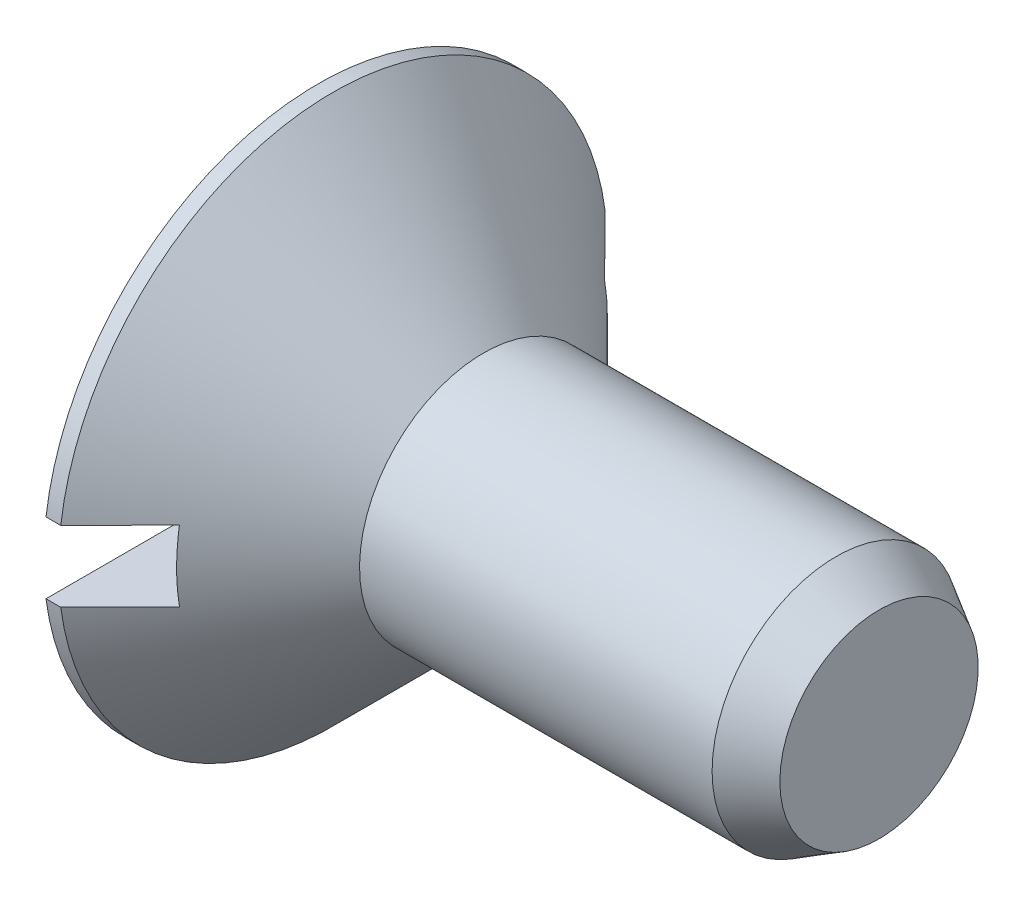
ISO-10303-21;
HEADER;
FILE_DESCRIPTION(('STEP AP214'),'2;1');
FILE_NAME('part.step','',(''),(''),'','','');
FILE_SCHEMA(('AUTOMOTIVE_DESIGN { 1 0 10303 214 1 1 1 1 }'));
ENDSEC;
DATA;
#1=APPLICATION_CONTEXT('core data for automotive mechanical design processes');
#2=APPLICATION_PROTOCOL_DEFINITION('international standard','automotive_design',2000,#1);
#3=PRODUCT_CONTEXT('',#1,'mechanical');
#4=PRODUCT('Part','Part','',(#3));
#5=PRODUCT_RELATED_PRODUCT_CATEGORY('part','',(#4));
#6=PRODUCT_DEFINITION_FORMATION('','',#4);
#7=PRODUCT_DEFINITION_CONTEXT('part definition',#1,'design');
#8=PRODUCT_DEFINITION('design','',#6,#7);
#9=PRODUCT_DEFINITION_SHAPE('','',#8);
#10=(LENGTH_UNIT() NAMED_UNIT(*) SI_UNIT(.MILLI.,.METRE.));
#11=(NAMED_UNIT(*) PLANE_ANGLE_UNIT() SI_UNIT($,.RADIAN.));
#12=(NAMED_UNIT(*) SI_UNIT($,.STERADIAN.) SOLID_ANGLE_UNIT());
#13=UNCERTAINTY_MEASURE_WITH_UNIT(LENGTH_MEASURE(1.E-05),#10,'distance_accuracy_value','');
#14=(GEOMETRIC_REPRESENTATION_CONTEXT(3) GLOBAL_UNCERTAINTY_ASSIGNED_CONTEXT((#13)) GLOBAL_UNIT_ASSIGNED_CONTEXT((#10,
#11,#12)) REPRESENTATION_CONTEXT('',''));
#15=CARTESIAN_POINT('',(0.,0.,0.));
#16=DIRECTION('',(0.,0.,1.));
#17=DIRECTION('',(1.,0.,0.));
#18=AXIS2_PLACEMENT_3D('',#15,#16,#17);
#19=CARTESIAN_POINT('',(0.,0.,0.));
#20=DIRECTION('',(-1.,0.,0.));
#21=DIRECTION('',(0.,0.,1.));
#22=AXIS2_PLACEMENT_3D('',#19,#20,#21);
#23=PLANE('',#22);
#24=DIRECTION('',(0.,0.,1.));
#25=VECTOR('',#24,1.);
#26=CARTESIAN_POINT('',(0.,0.6,-4.65));
#27=LINE('',#26,#25);
#28=CARTESIAN_POINT('',(0.,0.6,-4.61112784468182));
#29=VERTEX_POINT('',#28);
#30=CARTESIAN_POINT('',(0.,0.6,4.61112784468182));
#31=VERTEX_POINT('',#30);
#32=EDGE_CURVE('E188',#29,#31,#27,.T.);
#33=ORIENTED_EDGE('',*,*,#32,.T.);
#34=CARTESIAN_POINT('',(0.,0.,0.));
#35=DIRECTION('',(1.,0.,0.));
#36=DIRECTION('',(0.,0.,-1.));
#37=AXIS2_PLACEMENT_3D('',#34,#35,#36);
#38=CIRCLE('',#37,4.65);
#39=EDGE_CURVE('E125',#29,#31,#38,.T.);
#40=ORIENTED_EDGE('',*,*,#39,.F.);
#41=EDGE_LOOP('',(#33,#40));
#42=FACE_BOUND('',#41,.T.);
#43=ADVANCED_FACE('F45',(#42),#23,.T.);
#44=CARTESIAN_POINT('',(6.62068469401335,0.,0.));
#45=DIRECTION('',(1.,0.,0.));
#46=DIRECTION('',(0.,0.,-1.));
#47=AXIS2_PLACEMENT_3D('',#44,#45,#46);
#48=CYLINDRICAL_SURFACE('',#47,4.65);
#49=DIRECTION('',(1.,0.,0.));
#50=VECTOR('',#49,1.);
#51=CARTESIAN_POINT('',(6.62068469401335,0.6,4.61112784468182));
#52=LINE('',#51,#50);
#53=CARTESIAN_POINT('',(0.249999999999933,0.6,4.61112784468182));
#54=VERTEX_POINT('',#53);
#55=EDGE_CURVE('E185',#54,#31,#52,.F.);
#56=ORIENTED_EDGE('',*,*,#55,.F.);
#57=CARTESIAN_POINT('',(0.249999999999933,0.,0.));
#58=DIRECTION('',(1.,0.,0.));
#59=DIRECTION('',(0.,0.,-1.));
#60=AXIS2_PLACEMENT_3D('',#57,#58,#59);
#61=CIRCLE('',#60,4.65);
#62=CARTESIAN_POINT('',(0.249999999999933,0.6,-4.61112784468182));
#63=VERTEX_POINT('',#62);
#64=EDGE_CURVE('E177',#63,#54,#61,.T.);
#65=ORIENTED_EDGE('',*,*,#64,.F.);
#66=DIRECTION('',(1.,0.,0.));
#67=VECTOR('',#66,1.);
#68=CARTESIAN_POINT('',(6.62068469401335,0.6,-4.61112784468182));
#69=LINE('',#68,#67);
#70=EDGE_CURVE('E68',#29,#63,#69,.T.);
#71=ORIENTED_EDGE('',*,*,#70,.F.);
#72=ORIENTED_EDGE('',*,*,#39,.T.);
#73=EDGE_LOOP('',(#56,#65,#71,#72));
#74=FACE_BOUND('',#73,.T.);
#75=ADVANCED_FACE('F158',(#74),#48,.T.);
#76=DIRECTION('',(0.,0.,1.));
#77=VECTOR('',#76,1.);
#78=CARTESIAN_POINT('',(0.,-0.6,-4.65));
#79=LINE('',#78,#77);
#80=CARTESIAN_POINT('',(0.,-0.6,-4.61112784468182));
#81=VERTEX_POINT('',#80);
#82=CARTESIAN_POINT('',(0.,-0.6,4.61112784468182));
#83=VERTEX_POINT('',#82);
#84=EDGE_CURVE('E116',#81,#83,#79,.T.);
#85=ORIENTED_EDGE('',*,*,#84,.F.);
#86=EDGE_CURVE('E128',#83,#81,#38,.T.);
#87=ORIENTED_EDGE('',*,*,#86,.F.);
#88=EDGE_LOOP('',(#85,#87));
#89=FACE_BOUND('',#88,.T.);
#90=ADVANCED_FACE('F160',(#89),#23,.T.);
#91=DIRECTION('',(1.,0.,0.));
#92=VECTOR('',#91,1.);
#93=CARTESIAN_POINT('',(6.62068469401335,-0.6,-4.61112784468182));
#94=LINE('',#93,#92);
#95=CARTESIAN_POINT('',(0.249999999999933,-0.6,-4.61112784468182));
#96=VERTEX_POINT('',#95);
#97=EDGE_CURVE('E176',#96,#81,#94,.F.);
#98=ORIENTED_EDGE('',*,*,#97,.F.);
#99=CARTESIAN_POINT('',(0.249999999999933,-0.6,4.61112784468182));
#100=VERTEX_POINT('',#99);
#101=EDGE_CURVE('E178',#100,#96,#61,.T.);
#102=ORIENTED_EDGE('',*,*,#101,.F.);
#103=DIRECTION('',(1.,0.,0.));
#104=VECTOR('',#103,1.);
#105=CARTESIAN_POINT('',(6.62068469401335,-0.6,4.61112784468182));
#106=LINE('',#105,#104);
#107=EDGE_CURVE('E99',#83,#100,#106,.T.);
#108=ORIENTED_EDGE('',*,*,#107,.F.);
#109=ORIENTED_EDGE('',*,*,#86,.T.);
#110=EDGE_LOOP('',(#98,#102,#108,#109));
#111=FACE_BOUND('',#110,.T.);
#112=ADVANCED_FACE('F155',(#111),#48,.T.);
#113=CARTESIAN_POINT('',(2.8,0.,0.));
#114=DIRECTION('',(-1.,0.,0.));
#115=DIRECTION('',(0.,0.,1.));
#116=AXIS2_PLACEMENT_3D('',#113,#114,#115);
#117=CONICAL_SURFACE('',#116,2.1,0.785398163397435);
#118=CARTESIAN_POINT('',(-5.36236535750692,0.6,-10.244810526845));
#119=CARTESIAN_POINT('',(-5.01492393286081,0.6,-9.89676929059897));
#120=CARTESIAN_POINT('',(-4.6675085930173,0.6,-9.5487020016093));
#121=CARTESIAN_POINT('',(-3.97275824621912,0.6,-8.8524784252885));
#122=CARTESIAN_POINT('',(-3.6254232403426,0.6,-8.50432213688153));
#123=CARTESIAN_POINT('',(-2.93077201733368,0.6,-7.80779370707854));
#124=CARTESIAN_POINT('',(-2.58345583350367,0.6,-7.45942153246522));
#125=CARTESIAN_POINT('',(-1.88900593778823,0.6,-6.7625039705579));
#126=CARTESIAN_POINT('',(-1.5418722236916,0.6,-6.41395858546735));
#127=CARTESIAN_POINT('',(-0.835034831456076,0.6,-5.70367605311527));
#128=CARTESIAN_POINT('',(-0.475341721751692,0.6,-5.34192838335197));
#129=CARTESIAN_POINT('',(0.0637931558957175,0.6,-4.79889094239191));
#130=CARTESIAN_POINT('',(0.243440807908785,0.6,-4.61780561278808));
#131=CARTESIAN_POINT('',(0.602538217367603,0.6,-4.2554402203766));
#132=CARTESIAN_POINT('',(0.78198797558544,0.6,-4.07416015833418));
#133=CARTESIAN_POINT('',(1.14056709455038,0.6,-3.71134808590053));
#134=CARTESIAN_POINT('',(1.31969650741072,0.6,-3.52981612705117));
#135=CARTESIAN_POINT('',(1.67750681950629,0.6,-3.1663053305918));
#136=CARTESIAN_POINT('',(1.85618771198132,0.6,-2.98432648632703));
#137=CARTESIAN_POINT('',(2.21279362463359,0.6,-2.61965200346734));
#138=CARTESIAN_POINT('',(2.39071869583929,0.6,-2.43695641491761));
#139=CARTESIAN_POINT('',(2.65652848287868,0.6,-2.16187514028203));
#140=CARTESIAN_POINT('',(2.74495104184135,0.6,-2.07000952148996));
#141=CARTESIAN_POINT('',(2.92126344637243,0.6,-1.88576886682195));
#142=CARTESIAN_POINT('',(3.00915329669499,0.6,-1.79339383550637));
#143=CARTESIAN_POINT('',(3.14363246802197,0.6,-1.65078711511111));
#144=CARTESIAN_POINT('',(3.19051519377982,0.6,-1.60083228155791));
#145=CARTESIAN_POINT('',(3.2839678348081,0.6,-1.50062916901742));
#146=CARTESIAN_POINT('',(3.33053774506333,0.6,-1.45038088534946));
#147=CARTESIAN_POINT('',(3.42309309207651,0.6,-1.34968430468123));
#148=CARTESIAN_POINT('',(3.46908003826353,0.6,-1.29923739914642));
#149=CARTESIAN_POINT('',(3.56047910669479,0.6,-1.19782938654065));
#150=CARTESIAN_POINT('',(3.60589124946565,0.6,-1.14686829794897));
#151=CARTESIAN_POINT('',(3.71119354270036,0.6,-1.02682664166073));
#152=CARTESIAN_POINT('',(3.77076775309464,0.6,-0.957465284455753));
#153=CARTESIAN_POINT('',(3.85843446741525,0.6,-0.85161296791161));
#154=CARTESIAN_POINT('',(3.88746885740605,0.6,-0.815904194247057));
#155=CARTESIAN_POINT('',(3.94463825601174,0.6,-0.743776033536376));
#156=CARTESIAN_POINT('',(3.97277335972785,0.6,-0.707356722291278));
#157=CARTESIAN_POINT('',(4.02814415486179,0.6,-0.633052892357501));
#158=CARTESIAN_POINT('',(4.05536222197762,0.6,-0.595155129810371));
#159=CARTESIAN_POINT('',(4.10787021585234,0.6,-0.517952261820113));
#160=CARTESIAN_POINT('',(4.13315748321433,0.6,-0.478645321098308));
#161=CARTESIAN_POINT('',(4.18040572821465,0.6,-0.398562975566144));
#162=CARTESIAN_POINT('',(4.20239717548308,0.6,-0.357805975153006));
#163=CARTESIAN_POINT('',(4.24141981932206,0.6,-0.274042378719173));
#164=CARTESIAN_POINT('',(4.25846680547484,0.6,-0.231043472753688));
#165=CARTESIAN_POINT('',(4.28361225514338,0.6,-0.146293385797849));
#166=CARTESIAN_POINT('',(4.29234785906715,0.6,-0.104746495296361));
#167=CARTESIAN_POINT('',(4.29890711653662,0.6,-0.041851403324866));
#168=CARTESIAN_POINT('',(4.30000676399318,0.6,-0.0208294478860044));
#169=CARTESIAN_POINT('',(4.29999317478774,0.6,0.021212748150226));
#170=CARTESIAN_POINT('',(4.29887986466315,0.6,0.0422329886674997));
#171=CARTESIAN_POINT('',(4.2923271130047,0.6,0.104705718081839));
#172=CARTESIAN_POINT('',(4.28370245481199,0.6,0.145848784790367));
#173=CARTESIAN_POINT('',(4.2658828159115,0.6,0.206119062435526));
#174=CARTESIAN_POINT('',(4.25909422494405,0.6,0.22604077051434));
#175=CARTESIAN_POINT('',(4.24418139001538,0.6,0.265379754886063));
#176=CARTESIAN_POINT('',(4.23605736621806,0.6,0.284797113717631));
#177=CARTESIAN_POINT('',(4.21171067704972,0.6,0.338683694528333));
#178=CARTESIAN_POINT('',(4.19426177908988,0.6,0.372593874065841));
#179=CARTESIAN_POINT('',(4.15699755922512,0.6,0.439101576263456));
#180=CARTESIAN_POINT('',(4.13717958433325,0.6,0.471697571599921));
#181=CARTESIAN_POINT('',(4.09586201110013,0.6,0.535952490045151));
#182=CARTESIAN_POINT('',(4.07435693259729,0.6,0.567607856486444));
#183=CARTESIAN_POINT('',(4.03019875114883,0.6,0.630111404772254));
#184=CARTESIAN_POINT('',(4.00754536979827,0.6,0.660959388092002));
#185=CARTESIAN_POINT('',(3.9379272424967,0.6,0.75315010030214));
#186=CARTESIAN_POINT('',(3.88970782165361,0.6,0.81354123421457));
#187=CARTESIAN_POINT('',(3.79153604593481,0.6,0.932633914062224));
#188=CARTESIAN_POINT('',(3.74158799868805,0.6,0.991339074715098));
#189=CARTESIAN_POINT('',(3.64160285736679,0.6,1.10650906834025));
#190=CARTESIAN_POINT('',(3.59159003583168,0.6,1.16299501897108));
#191=CARTESIAN_POINT('',(3.49082200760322,0.6,1.2753003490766));
#192=CARTESIAN_POINT('',(3.44006678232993,0.6,1.33111971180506));
#193=CARTESIAN_POINT('',(3.28702208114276,0.6,1.49789013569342));
#194=CARTESIAN_POINT('',(3.18396742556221,0.6,1.60813787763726));
#195=CARTESIAN_POINT('',(2.97664172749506,0.6,1.82772673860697));
#196=CARTESIAN_POINT('',(2.87236937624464,0.6,1.93706661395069));
#197=CARTESIAN_POINT('',(2.66315676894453,0.6,2.15508896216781));
#198=CARTESIAN_POINT('',(2.55821656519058,0.6,2.26377148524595));
#199=CARTESIAN_POINT('',(2.3489716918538,0.6,2.47960357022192));
#200=CARTESIAN_POINT('',(2.24467147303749,0.6,2.58675745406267));
#201=CARTESIAN_POINT('',(2.03577071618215,0.6,2.80077615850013));
#202=CARTESIAN_POINT('',(1.93117017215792,0.6,2.90764097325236));
#203=CARTESIAN_POINT('',(1.61715388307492,0.6,3.22782187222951));
#204=CARTESIAN_POINT('',(1.40742246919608,0.6,3.4408282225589));
#205=CARTESIAN_POINT('',(0.927791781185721,0.6,3.92687936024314));
#206=CARTESIAN_POINT('',(0.65774080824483,0.6,4.19977427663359));
#207=CARTESIAN_POINT('',(0.117210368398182,0.6,4.74514082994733));
#208=CARTESIAN_POINT('',(-0.153269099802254,0.6,5.01761246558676));
#209=CARTESIAN_POINT('',(-0.965199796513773,0.6,5.83475977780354));
#210=CARTESIAN_POINT('',(-1.50703268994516,0.6,6.37905610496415));
#211=CARTESIAN_POINT('',(-2.60102565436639,0.6,7.47713689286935));
#212=CARTESIAN_POINT('',(-3.15319380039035,0.6,8.03091330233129));
#213=CARTESIAN_POINT('',(-4.2576821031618,0.6,9.13807762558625));
#214=CARTESIAN_POINT('',(-4.81000220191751,0.6,9.69146559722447));
#215=CARTESIAN_POINT('',(-5.36236535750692,0.6,10.244810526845));
#216=B_SPLINE_CURVE_WITH_KNOTS('',3,(#118,#119,#120,#121,#122,#123,#124,#125,#126,#127,#128,
#129,#130,#131,#132,#133,#134,#135,#136,#137,#138,#139,#140,#141,#142,#143,#144,#145,#146,#147,
#148,#149,#150,#151,#152,#153,#154,#155,#156,#157,#158,#159,#160,#161,#162,#163,#164,#165,#166,
#167,#168,#169,#170,#171,#172,#173,#174,#175,#176,#177,#178,#179,#180,#181,#182,#183,#184,#185,
#186,#187,#188,#189,#190,#191,#192,#193,#194,#195,#196,#197,#198,#199,#200,#201,#202,#203,#204,
#205,#206,#207,#208,#209,#210,#211,#212,#213,#214,#215),.UNSPECIFIED.,.F.,.F.,(4,2,2,2,2,2,2,2,
2,2,2,2,2,2,2,2,2,2,2,2,2,2,2,2,2,2,2,2,2,2,2,2,2,2,2,2,2,2,2,2,2,2,2,2,2,2,2,2,4),(0.,
1.47534207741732,2.95070292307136,4.42648244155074,5.9022436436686,7.43265646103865,
8.19789264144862,8.96312582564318,9.72822050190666,10.4933266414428,11.2583802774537,
11.6408978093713,12.0234119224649,12.2289377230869,12.4344668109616,12.6392486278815,
12.8440231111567,13.1182810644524,13.2563401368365,13.3943845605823,13.5343219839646,
13.6744487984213,13.8131874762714,13.9514781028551,14.0780213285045,14.1410633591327,
14.2041074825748,14.3293725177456,14.3924826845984,14.4555824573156,14.5698365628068,
14.6842198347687,14.7989913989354,14.913790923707,15.1455512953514,15.376770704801,
15.6030949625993,15.8294248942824,16.2821474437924,16.7354120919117,17.1886416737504,
17.6372437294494,18.0858547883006,18.9826423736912,20.1344195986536,21.2862003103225,
23.5902334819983,25.9362986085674,28.2818606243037),.UNSPECIFIED.);
#217=CARTESIAN_POINT('',(1.25,0.6,3.6003472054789));
#218=VERTEX_POINT('',#217);
#219=EDGE_CURVE('E122',#218,#54,#216,.T.);
#220=ORIENTED_EDGE('',*,*,#219,.F.);
#221=CARTESIAN_POINT('',(1.25,0.,0.));
#222=DIRECTION('',(1.,0.,0.));
#223=DIRECTION('',(0.,0.,-1.));
#224=AXIS2_PLACEMENT_3D('',#221,#222,#223);
#225=CIRCLE('',#224,3.64999999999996);
#226=CARTESIAN_POINT('',(1.25,-0.6,3.6003472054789));
#227=VERTEX_POINT('',#226);
#228=EDGE_CURVE('E104',#227,#218,#225,.F.);
#229=ORIENTED_EDGE('',*,*,#228,.F.);
#230=CARTESIAN_POINT('',(-5.36236535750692,-0.6,10.244810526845));
#231=CARTESIAN_POINT('',(-5.01492393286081,-0.6,9.89676929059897));
#232=CARTESIAN_POINT('',(-4.6675085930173,-0.6,9.5487020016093));
#233=CARTESIAN_POINT('',(-3.97275824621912,-0.6,8.8524784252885));
#234=CARTESIAN_POINT('',(-3.6254232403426,-0.6,8.50432213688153));
#235=CARTESIAN_POINT('',(-2.93077201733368,-0.6,7.80779370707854));
#236=CARTESIAN_POINT('',(-2.58345583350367,-0.6,7.45942153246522));
#237=CARTESIAN_POINT('',(-1.88900593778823,-0.6,6.7625039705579));
#238=CARTESIAN_POINT('',(-1.5418722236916,-0.6,6.41395858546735));
#239=CARTESIAN_POINT('',(-0.835034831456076,-0.6,5.70367605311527));
#240=CARTESIAN_POINT('',(-0.475341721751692,-0.6,5.34192838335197));
#241=CARTESIAN_POINT('',(0.0637931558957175,-0.6,4.79889094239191));
#242=CARTESIAN_POINT('',(0.243440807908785,-0.6,4.61780561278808));
#243=CARTESIAN_POINT('',(0.602538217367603,-0.6,4.2554402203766));
#244=CARTESIAN_POINT('',(0.78198797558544,-0.6,4.07416015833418));
#245=CARTESIAN_POINT('',(1.14056709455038,-0.6,3.71134808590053));
#246=CARTESIAN_POINT('',(1.31969650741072,-0.6,3.52981612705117));
#247=CARTESIAN_POINT('',(1.67750681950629,-0.6,3.1663053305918));
#248=CARTESIAN_POINT('',(1.85618771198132,-0.6,2.98432648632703));
#249=CARTESIAN_POINT('',(2.21279362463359,-0.6,2.61965200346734));
#250=CARTESIAN_POINT('',(2.39071869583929,-0.6,2.43695641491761));
#251=CARTESIAN_POINT('',(2.65652848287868,-0.6,2.16187514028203));
#252=CARTESIAN_POINT('',(2.74495104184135,-0.6,2.07000952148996));
#253=CARTESIAN_POINT('',(2.92126344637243,-0.6,1.88576886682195));
#254=CARTESIAN_POINT('',(3.00915329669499,-0.6,1.79339383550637));
#255=CARTESIAN_POINT('',(3.14363246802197,-0.6,1.65078711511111));
#256=CARTESIAN_POINT('',(3.19051519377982,-0.6,1.60083228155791));
#257=CARTESIAN_POINT('',(3.2839678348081,-0.6,1.50062916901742));
#258=CARTESIAN_POINT('',(3.33053774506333,-0.6,1.45038088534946));
#259=CARTESIAN_POINT('',(3.42309309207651,-0.6,1.34968430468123));
#260=CARTESIAN_POINT('',(3.46908003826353,-0.6,1.29923739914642));
#261=CARTESIAN_POINT('',(3.56047910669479,-0.6,1.19782938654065));
#262=CARTESIAN_POINT('',(3.60589124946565,-0.6,1.14686829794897));
#263=CARTESIAN_POINT('',(3.71119354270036,-0.6,1.02682664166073));
#264=CARTESIAN_POINT('',(3.77076775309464,-0.6,0.957465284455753));
#265=CARTESIAN_POINT('',(3.85843446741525,-0.6,0.85161296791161));
#266=CARTESIAN_POINT('',(3.88746885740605,-0.6,0.815904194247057));
#267=CARTESIAN_POINT('',(3.94463825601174,-0.6,0.743776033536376));
#268=CARTESIAN_POINT('',(3.97277335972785,-0.6,0.707356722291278));
#269=CARTESIAN_POINT('',(4.02814415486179,-0.6,0.633052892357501));
#270=CARTESIAN_POINT('',(4.05536222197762,-0.6,0.595155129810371));
#271=CARTESIAN_POINT('',(4.10787021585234,-0.6,0.517952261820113));
#272=CARTESIAN_POINT('',(4.13315748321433,-0.6,0.478645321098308));
#273=CARTESIAN_POINT('',(4.18040572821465,-0.6,0.398562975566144));
#274=CARTESIAN_POINT('',(4.20239717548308,-0.6,0.357805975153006));
#275=CARTESIAN_POINT('',(4.24141981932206,-0.6,0.274042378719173));
#276=CARTESIAN_POINT('',(4.25846680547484,-0.6,0.231043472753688));
#277=CARTESIAN_POINT('',(4.28361225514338,-0.6,0.146293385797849));
#278=CARTESIAN_POINT('',(4.29234785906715,-0.6,0.104746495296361));
#279=CARTESIAN_POINT('',(4.29890711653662,-0.6,0.041851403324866));
#280=CARTESIAN_POINT('',(4.30000676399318,-0.6,0.0208294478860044));
#281=CARTESIAN_POINT('',(4.29999317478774,-0.6,-0.021212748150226));
#282=CARTESIAN_POINT('',(4.29887986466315,-0.6,-0.0422329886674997));
#283=CARTESIAN_POINT('',(4.2923271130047,-0.6,-0.104705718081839));
#284=CARTESIAN_POINT('',(4.28370245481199,-0.6,-0.145848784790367));
#285=CARTESIAN_POINT('',(4.2658828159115,-0.6,-0.206119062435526));
#286=CARTESIAN_POINT('',(4.25909422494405,-0.6,-0.22604077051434));
#287=CARTESIAN_POINT('',(4.24418139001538,-0.6,-0.265379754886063));
#288=CARTESIAN_POINT('',(4.23605736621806,-0.6,-0.284797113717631));
#289=CARTESIAN_POINT('',(4.21171067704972,-0.6,-0.338683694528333));
#290=CARTESIAN_POINT('',(4.19426177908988,-0.6,-0.372593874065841));
#291=CARTESIAN_POINT('',(4.15699755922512,-0.6,-0.439101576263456));
#292=CARTESIAN_POINT('',(4.13717958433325,-0.6,-0.471697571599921));
#293=CARTESIAN_POINT('',(4.09586201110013,-0.6,-0.535952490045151));
#294=CARTESIAN_POINT('',(4.07435693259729,-0.6,-0.567607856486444));
#295=CARTESIAN_POINT('',(4.03019875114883,-0.6,-0.630111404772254));
#296=CARTESIAN_POINT('',(4.00754536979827,-0.6,-0.660959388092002));
#297=CARTESIAN_POINT('',(3.9379272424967,-0.6,-0.75315010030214));
#298=CARTESIAN_POINT('',(3.88970782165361,-0.6,-0.81354123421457));
#299=CARTESIAN_POINT('',(3.79153604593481,-0.6,-0.932633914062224));
#300=CARTESIAN_POINT('',(3.74158799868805,-0.6,-0.991339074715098));
#301=CARTESIAN_POINT('',(3.64160285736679,-0.6,-1.10650906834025));
#302=CARTESIAN_POINT('',(3.59159003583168,-0.6,-1.16299501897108));
#303=CARTESIAN_POINT('',(3.49082200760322,-0.6,-1.2753003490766));
#304=CARTESIAN_POINT('',(3.44006678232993,-0.6,-1.33111971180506));
#305=CARTESIAN_POINT('',(3.28702208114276,-0.6,-1.49789013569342));
#306=CARTESIAN_POINT('',(3.18396742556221,-0.6,-1.60813787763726));
#307=CARTESIAN_POINT('',(2.97664172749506,-0.6,-1.82772673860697));
#308=CARTESIAN_POINT('',(2.87236937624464,-0.6,-1.93706661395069));
#309=CARTESIAN_POINT('',(2.66315676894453,-0.6,-2.15508896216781));
#310=CARTESIAN_POINT('',(2.55821656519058,-0.6,-2.26377148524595));
#311=CARTESIAN_POINT('',(2.3489716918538,-0.6,-2.47960357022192));
#312=CARTESIAN_POINT('',(2.24467147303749,-0.6,-2.58675745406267));
#313=CARTESIAN_POINT('',(2.03577071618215,-0.6,-2.80077615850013));
#314=CARTESIAN_POINT('',(1.93117017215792,-0.6,-2.90764097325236));
#315=CARTESIAN_POINT('',(1.61715388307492,-0.6,-3.22782187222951));
#316=CARTESIAN_POINT('',(1.40742246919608,-0.6,-3.4408282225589));
#317=CARTESIAN_POINT('',(0.927791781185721,-0.6,-3.92687936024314));
#318=CARTESIAN_POINT('',(0.65774080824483,-0.6,-4.19977427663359));
#319=CARTESIAN_POINT('',(0.117210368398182,-0.6,-4.74514082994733));
#320=CARTESIAN_POINT('',(-0.153269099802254,-0.6,-5.01761246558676));
#321=CARTESIAN_POINT('',(-0.965199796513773,-0.6,-5.83475977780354));
#322=CARTESIAN_POINT('',(-1.50703268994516,-0.6,-6.37905610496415));
#323=CARTESIAN_POINT('',(-2.60102565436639,-0.6,-7.47713689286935));
#324=CARTESIAN_POINT('',(-3.15319380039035,-0.6,-8.03091330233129));
#325=CARTESIAN_POINT('',(-4.2576821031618,-0.6,-9.13807762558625));
#326=CARTESIAN_POINT('',(-4.81000220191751,-0.6,-9.69146559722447));
#327=CARTESIAN_POINT('',(-5.36236535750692,-0.6,-10.244810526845));
#328=B_SPLINE_CURVE_WITH_KNOTS('',3,(#230,#231,#232,#233,#234,#235,#236,#237,#238,#239,#240,
#241,#242,#243,#244,#245,#246,#247,#248,#249,#250,#251,#252,#253,#254,#255,#256,#257,#258,#259,
#260,#261,#262,#263,#264,#265,#266,#267,#268,#269,#270,#271,#272,#273,#274,#275,#276,#277,#278,
#279,#280,#281,#282,#283,#284,#285,#286,#287,#288,#289,#290,#291,#292,#293,#294,#295,#296,#297,
#298,#299,#300,#301,#302,#303,#304,#305,#306,#307,#308,#309,#310,#311,#312,#313,#314,#315,#316,
#317,#318,#319,#320,#321,#322,#323,#324,#325,#326,#327),.UNSPECIFIED.,.F.,.F.,(4,2,2,2,2,2,2,2,
2,2,2,2,2,2,2,2,2,2,2,2,2,2,2,2,2,2,2,2,2,2,2,2,2,2,2,2,2,2,2,2,2,2,2,2,2,2,2,2,4),(0.,
1.47534207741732,2.95070292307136,4.42648244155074,5.9022436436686,7.43265646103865,
8.19789264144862,8.96312582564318,9.72822050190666,10.4933266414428,11.2583802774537,
11.6408978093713,12.0234119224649,12.2289377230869,12.4344668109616,12.6392486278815,
12.8440231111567,13.1182810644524,13.2563401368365,13.3943845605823,13.5343219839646,
13.6744487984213,13.8131874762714,13.9514781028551,14.0780213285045,14.1410633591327,
14.2041074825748,14.3293725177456,14.3924826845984,14.4555824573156,14.5698365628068,
14.6842198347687,14.7989913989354,14.913790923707,15.1455512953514,15.376770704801,
15.6030949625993,15.8294248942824,16.2821474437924,16.7354120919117,17.1886416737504,
17.6372437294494,18.0858547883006,18.9826423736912,20.1344195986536,21.2862003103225,
23.5902334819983,25.9362986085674,28.2818606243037),.UNSPECIFIED.);
#329=EDGE_CURVE('E96',#100,#227,#328,.T.);
#330=ORIENTED_EDGE('',*,*,#329,.F.);
#331=ORIENTED_EDGE('',*,*,#101,.T.);
#332=CARTESIAN_POINT('',(1.25,-0.6,-3.6003472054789));
#333=VERTEX_POINT('',#332);
#334=EDGE_CURVE('E107',#333,#96,#328,.T.);
#335=ORIENTED_EDGE('',*,*,#334,.F.);
#336=CARTESIAN_POINT('',(1.25,0.6,-3.6003472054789));
#337=VERTEX_POINT('',#336);
#338=EDGE_CURVE('E113',#337,#333,#225,.F.);
#339=ORIENTED_EDGE('',*,*,#338,.F.);
#340=EDGE_CURVE('E105',#63,#337,#216,.T.);
#341=ORIENTED_EDGE('',*,*,#340,.F.);
#342=ORIENTED_EDGE('',*,*,#64,.T.);
#343=EDGE_LOOP('',(#220,#229,#330,#331,#335,#339,#341,#342));
#344=FACE_BOUND('',#343,.T.);
#345=CARTESIAN_POINT('',(2.8,0.,0.));
#346=DIRECTION('',(1.,0.,0.));
#347=DIRECTION('',(0.,0.,-1.));
#348=AXIS2_PLACEMENT_3D('',#345,#346,#347);
#349=CIRCLE('',#348,2.1);
#350=CARTESIAN_POINT('',(2.8,0.,-2.1));
#351=VERTEX_POINT('',#350);
#352=EDGE_CURVE('E180',#351,#351,#349,.T.);
#353=ORIENTED_EDGE('',*,*,#352,.F.);
#354=EDGE_LOOP('',(#353));
#355=FACE_BOUND('',#354,.T.);
#356=ADVANCED_FACE('F119',(#344,#355),#117,.T.);
#357=CARTESIAN_POINT('',(6.62068469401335,0.,0.));
#358=DIRECTION('',(1.,0.,0.));
#359=DIRECTION('',(0.,0.,-1.));
#360=AXIS2_PLACEMENT_3D('',#357,#358,#359);
#361=CYLINDRICAL_SURFACE('',#360,2.1);
#362=CARTESIAN_POINT('',(8.77253866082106,0.,0.));
#363=DIRECTION('',(1.,0.,0.));
#364=DIRECTION('',(0.,0.,-1.));
#365=AXIS2_PLACEMENT_3D('',#362,#363,#364);
#366=CIRCLE('',#365,2.1);
#367=CARTESIAN_POINT('',(8.77253866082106,0.,2.1));
#368=VERTEX_POINT('',#367);
#369=EDGE_CURVE('E11',#368,#368,#366,.F.);
#370=ORIENTED_EDGE('',*,*,#369,.T.);
#371=EDGE_LOOP('',(#370));
#372=FACE_BOUND('',#371,.T.);
#373=ORIENTED_EDGE('',*,*,#352,.T.);
#374=EDGE_LOOP('',(#373));
#375=FACE_BOUND('',#374,.T.);
#376=ADVANCED_FACE('F148',(#372,#375),#361,.T.);
#377=CARTESIAN_POINT('',(9.5,2.1,0.));
#378=DIRECTION('',(1.,0.,0.));
#379=DIRECTION('',(0.,0.,-1.));
#380=AXIS2_PLACEMENT_3D('',#377,#378,#379);
#381=PLANE('',#380);
#382=CARTESIAN_POINT('',(9.5,0.,0.));
#383=DIRECTION('',(1.,0.,0.));
#384=DIRECTION('',(0.,0.,-1.));
#385=AXIS2_PLACEMENT_3D('',#382,#383,#384);
#386=CIRCLE('',#385,1.67999999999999);
#387=CARTESIAN_POINT('',(9.5,0.,1.67999999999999));
#388=VERTEX_POINT('',#387);
#389=EDGE_CURVE('E53',#388,#388,#386,.T.);
#390=ORIENTED_EDGE('',*,*,#389,.T.);
#391=EDGE_LOOP('',(#390));
#392=FACE_BOUND('',#391,.T.);
#393=ADVANCED_FACE('F145',(#392),#381,.T.);
#394=CARTESIAN_POINT('',(0.,0.6,-4.65));
#395=DIRECTION('',(0.,1.,0.));
#396=DIRECTION('',(0.,0.,1.));
#397=AXIS2_PLACEMENT_3D('',#394,#395,#396);
#398=PLANE('',#397);
#399=ORIENTED_EDGE('',*,*,#70,.T.);
#400=ORIENTED_EDGE('',*,*,#340,.T.);
#401=DIRECTION('',(0.,0.,1.));
#402=VECTOR('',#401,1.);
#403=CARTESIAN_POINT('',(1.25,0.6,-4.65));
#404=LINE('',#403,#402);
#405=EDGE_CURVE('E115',#337,#218,#404,.T.);
#406=ORIENTED_EDGE('',*,*,#405,.T.);
#407=ORIENTED_EDGE('',*,*,#219,.T.);
#408=ORIENTED_EDGE('',*,*,#55,.T.);
#409=ORIENTED_EDGE('',*,*,#32,.F.);
#410=EDGE_LOOP('',(#399,#400,#406,#407,#408,#409));
#411=FACE_BOUND('',#410,.T.);
#412=ADVANCED_FACE('F147',(#411),#398,.F.);
#413=CARTESIAN_POINT('',(1.25,0.6,-4.65));
#414=DIRECTION('',(1.,0.,0.));
#415=DIRECTION('',(0.,0.,-1.));
#416=AXIS2_PLACEMENT_3D('',#413,#414,#415);
#417=PLANE('',#416);
#418=ORIENTED_EDGE('',*,*,#228,.T.);
#419=ORIENTED_EDGE('',*,*,#405,.F.);
#420=ORIENTED_EDGE('',*,*,#338,.T.);
#421=DIRECTION('',(0.,0.,1.));
#422=VECTOR('',#421,1.);
#423=CARTESIAN_POINT('',(1.25,-0.6,-4.65));
#424=LINE('',#423,#422);
#425=EDGE_CURVE('E60',#333,#227,#424,.T.);
#426=ORIENTED_EDGE('',*,*,#425,.T.);
#427=EDGE_LOOP('',(#418,#419,#420,#426));
#428=FACE_BOUND('',#427,.T.);
#429=ADVANCED_FACE('F109',(#428),#417,.F.);
#430=CARTESIAN_POINT('',(0.,-0.6,-4.65));
#431=DIRECTION('',(0.,-1.,0.));
#432=DIRECTION('',(0.,0.,-1.));
#433=AXIS2_PLACEMENT_3D('',#430,#431,#432);
#434=PLANE('',#433);
#435=ORIENTED_EDGE('',*,*,#107,.T.);
#436=ORIENTED_EDGE('',*,*,#329,.T.);
#437=ORIENTED_EDGE('',*,*,#425,.F.);
#438=ORIENTED_EDGE('',*,*,#334,.T.);
#439=ORIENTED_EDGE('',*,*,#97,.T.);
#440=ORIENTED_EDGE('',*,*,#84,.T.);
#441=EDGE_LOOP('',(#435,#436,#437,#438,#439,#440));
#442=FACE_BOUND('',#441,.T.);
#443=ADVANCED_FACE('F97',(#442),#434,.F.);
#444=CARTESIAN_POINT('',(9.5,0.,0.));
#445=DIRECTION('',(-1.,0.,0.));
#446=DIRECTION('',(0.,0.,1.));
#447=AXIS2_PLACEMENT_3D('',#444,#445,#446);
#448=CONICAL_SURFACE('',#447,1.67999999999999,0.523598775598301);
#449=CARTESIAN_POINT('',(8.77253866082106,0.,2.1));
#450=CARTESIAN_POINT('',(8.78011638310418,0.,2.095625));
#451=CARTESIAN_POINT('',(8.78769410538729,0.,2.09125));
#452=CARTESIAN_POINT('',(8.80284954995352,0.,2.0825));
#453=CARTESIAN_POINT('',(8.81042727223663,0.,2.078125));
#454=CARTESIAN_POINT('',(8.82558271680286,0.,2.069375));
#455=CARTESIAN_POINT('',(8.83316043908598,0.,2.065));
#456=CARTESIAN_POINT('',(8.8483158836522,0.,2.05625));
#457=CARTESIAN_POINT('',(8.85589360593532,0.,2.051875));
#458=CARTESIAN_POINT('',(8.87104905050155,0.,2.043125));
#459=CARTESIAN_POINT('',(8.87862677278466,0.,2.03875));
#460=CARTESIAN_POINT('',(8.89378221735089,0.,2.03));
#461=CARTESIAN_POINT('',(8.901359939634,0.,2.025625));
#462=CARTESIAN_POINT('',(8.91651538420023,0.,2.016875));
#463=CARTESIAN_POINT('',(8.92409310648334,0.,2.0125));
#464=CARTESIAN_POINT('',(8.93924855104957,0.,2.00375));
#465=CARTESIAN_POINT('',(8.94682627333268,0.,1.999375));
#466=CARTESIAN_POINT('',(8.96198171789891,0.,1.990625));
#467=CARTESIAN_POINT('',(8.96955944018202,0.,1.98625));
#468=CARTESIAN_POINT('',(8.98471488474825,0.,1.9775));
#469=CARTESIAN_POINT('',(8.99229260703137,0.,1.973125));
#470=CARTESIAN_POINT('',(9.00744805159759,0.,1.964375));
#471=CARTESIAN_POINT('',(9.01502577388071,0.,1.96));
#472=CARTESIAN_POINT('',(9.03018121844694,0.,1.95125));
#473=CARTESIAN_POINT('',(9.03775894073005,0.,1.946875));
#474=CARTESIAN_POINT('',(9.05291438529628,0.,1.938125));
#475=CARTESIAN_POINT('',(9.06049210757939,0.,1.93375));
#476=CARTESIAN_POINT('',(9.07564755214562,0.,1.925));
#477=CARTESIAN_POINT('',(9.08322527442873,0.,1.920625));
#478=CARTESIAN_POINT('',(9.09838071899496,0.,1.911875));
#479=CARTESIAN_POINT('',(9.10595844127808,0.,1.9075));
#480=CARTESIAN_POINT('',(9.1211138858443,0.,1.89875));
#481=CARTESIAN_POINT('',(9.12869160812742,0.,1.894375));
#482=CARTESIAN_POINT('',(9.14384705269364,0.,1.885625));
#483=CARTESIAN_POINT('',(9.15142477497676,0.,1.88125));
#484=CARTESIAN_POINT('',(9.16658021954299,0.,1.8725));
#485=CARTESIAN_POINT('',(9.1741579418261,0.,1.868125));
#486=CARTESIAN_POINT('',(9.18931338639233,0.,1.859375));
#487=CARTESIAN_POINT('',(9.19689110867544,0.,1.855));
#488=CARTESIAN_POINT('',(9.21204655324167,0.,1.84625));
#489=CARTESIAN_POINT('',(9.21962427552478,0.,1.841875));
#490=CARTESIAN_POINT('',(9.23477972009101,0.,1.833125));
#491=CARTESIAN_POINT('',(9.24235744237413,0.,1.82875));
#492=CARTESIAN_POINT('',(9.25751288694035,0.,1.82));
#493=CARTESIAN_POINT('',(9.26509060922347,0.,1.815625));
#494=CARTESIAN_POINT('',(9.2802460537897,0.,1.806875));
#495=CARTESIAN_POINT('',(9.28782377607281,0.,1.8025));
#496=CARTESIAN_POINT('',(9.30297922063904,0.,1.79375));
#497=CARTESIAN_POINT('',(9.31055694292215,0.,1.789375));
#498=CARTESIAN_POINT('',(9.32571238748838,0.,1.780625));
#499=CARTESIAN_POINT('',(9.33329010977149,0.,1.77625));
#500=CARTESIAN_POINT('',(9.34844555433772,0.,1.7675));
#501=CARTESIAN_POINT('',(9.35602327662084,0.,1.763125));
#502=CARTESIAN_POINT('',(9.37117872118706,0.,1.754375));
#503=CARTESIAN_POINT('',(9.37875644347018,0.,1.75));
#504=CARTESIAN_POINT('',(9.3939118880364,0.,1.74125));
#505=CARTESIAN_POINT('',(9.40148961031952,0.,1.736875));
#506=CARTESIAN_POINT('',(9.41664505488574,0.,1.728125));
#507=CARTESIAN_POINT('',(9.42422277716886,0.,1.72375));
#508=CARTESIAN_POINT('',(9.43937822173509,0.,1.71499999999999));
#509=CARTESIAN_POINT('',(9.4469559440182,0.,1.71062499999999));
#510=CARTESIAN_POINT('',(9.46211138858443,0.,1.70187499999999));
#511=CARTESIAN_POINT('',(9.46968911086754,0.,1.69749999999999));
#512=CARTESIAN_POINT('',(9.48484455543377,0.,1.68874999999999));
#513=CARTESIAN_POINT('',(9.49242227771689,0.,1.68437499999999));
#514=CARTESIAN_POINT('',(9.5,0.,1.67999999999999));
#515=B_SPLINE_CURVE_WITH_KNOTS('',3,(#449,#450,#451,#452,#453,#454,#455,#456,#457,#458,#459,
#460,#461,#462,#463,#464,#465,#466,#467,#468,#469,#470,#471,#472,#473,#474,#475,#476,#477,#478,
#479,#480,#481,#482,#483,#484,#485,#486,#487,#488,#489,#490,#491,#492,#493,#494,#495,#496,#497,
#498,#499,#500,#501,#502,#503,#504,#505,#506,#507,#508,#509,#510,#511,#512,#513,#514),
.UNSPECIFIED.,.F.,.F.,(4,2,2,2,2,2,2,2,2,2,2,2,2,2,2,2,2,2,2,2,2,2,2,2,2,2,2,2,2,2,2,2,4),(0.,
0.0262500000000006,0.0525000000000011,0.0787500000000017,0.105000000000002,0.131250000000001,
0.157500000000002,0.183750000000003,0.210000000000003,0.236250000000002,0.262500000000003,
0.288750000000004,0.315000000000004,0.341250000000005,0.367500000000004,0.393750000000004,
0.420000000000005,0.446250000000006,0.472500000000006,0.498750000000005,0.525000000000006,
0.551250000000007,0.577500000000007,0.603750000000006,0.630000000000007,0.656250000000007,
0.682500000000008,0.708750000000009,0.735000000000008,0.761250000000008,0.787500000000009,
0.813750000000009,0.84000000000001),.UNSPECIFIED.);
#516=EDGE_CURVE('BSEAM47',#368,#388,#515,.T.);
#517=ORIENTED_EDGE('',*,*,#369,.F.);
#518=ORIENTED_EDGE('',*,*,#389,.F.);
#519=ORIENTED_EDGE('',*,*,#516,.T.);
#520=ORIENTED_EDGE('',*,*,#516,.F.);
#521=EDGE_LOOP('',(#517,#519,#518,#520));
#522=FACE_BOUND('',#521,.T.);
#523=ADVANCED_FACE('F47',(#522),#448,.T.);
#524=CLOSED_SHELL('',(#43,#75,#90,#112,#356,#376,#393,#412,#429,#443,#523));
#525=MANIFOLD_SOLID_BREP('B2',#524);
#526=ADVANCED_BREP_SHAPE_REPRESENTATION('',(#18,#525),#14);
#527=SHAPE_DEFINITION_REPRESENTATION(#9,#526);
ENDSEC;
END-ISO-10303-21;
